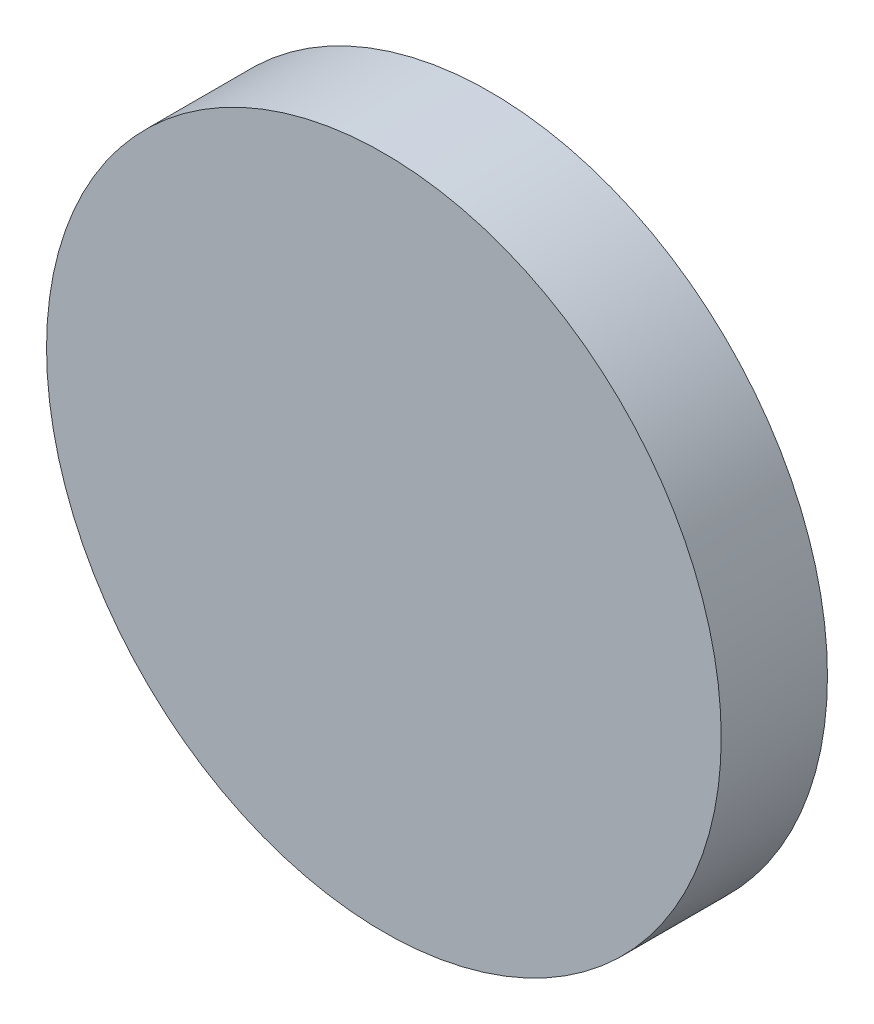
from build123d import *

# Parameters (mm, degrees)
SKETCH_1_R      = 12.7
EXTRUDE_1_DEPTH = 4


with BuildPart() as part:
    # Sketch 1 → Extrude 1 (new body)
    with BuildSketch(Plane.XY):
        Circle(SKETCH_1_R)
    extrude(amount=EXTRUDE_1_DEPTH)


solid = part.part
